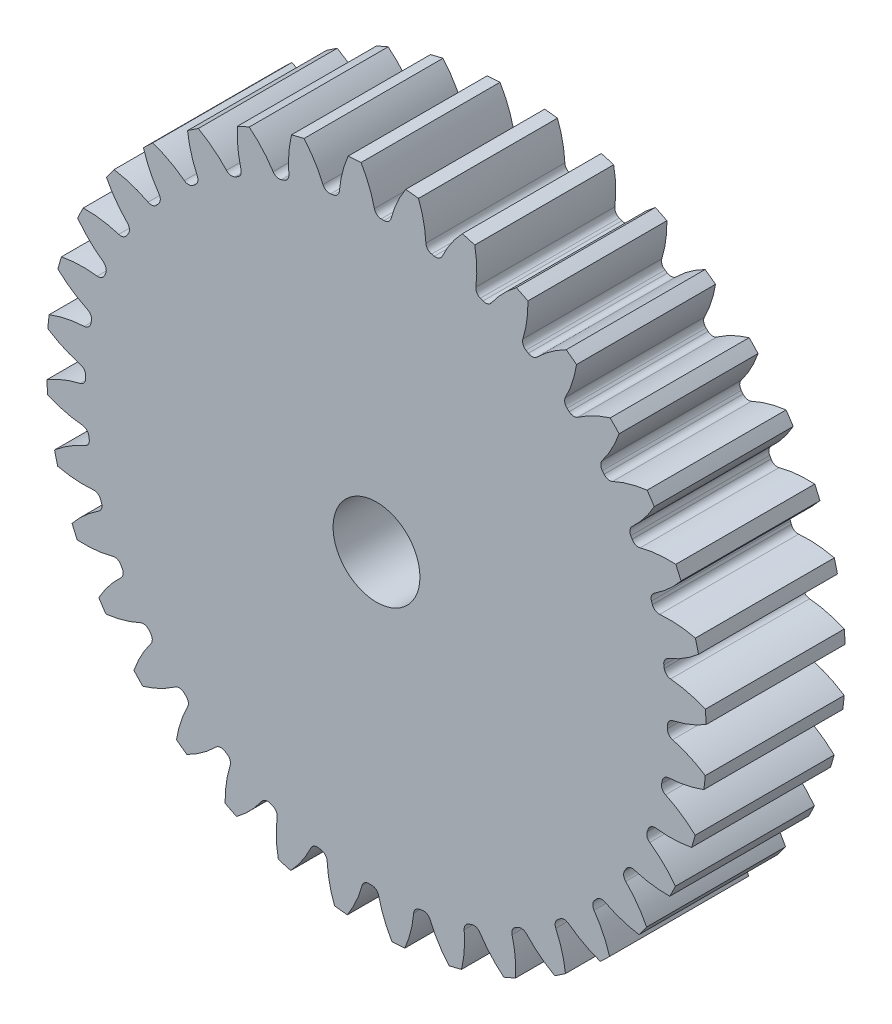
from build123d import *

# Parameters (mm, degrees)
SKETCH3_R         = 241.3
GEARBODY_DEPTH    = 101.6
TOOTHCUT_DEPTH    = 357.053282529
CIRPATTERN1_COUNT = 36
BOREDIA_R         = 31.75
BORE_DEPTH        = 12700


with BuildPart() as part:
    # Sketch3 → gearBody (new body)
    with BuildSketch(Plane.XY):
        Circle(SKETCH3_R)
    extrude(amount=GEARBODY_DEPTH)

    # Sketch2 → toothCut (cut, through all)
    with BuildSketch(Plane.XY):
        with BuildLine():
            ThreePointArc((212.65515344, -5.450810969), (212.678976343, -4.424776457), (212.697848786, -3.398638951))
            ThreePointArc((212.697848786, -3.398638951), (213.85352624, -0.222867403), (216.724480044, 1.560034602))
            ThreePointArc((216.724480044, 1.560034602), (229.412247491, 5.52895222), (241.3, 11.479842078))
            ThreePointArc((241.3, 11.479842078), (241.520657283, -5.024826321), (240.613730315, -21.506035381))
            ThreePointArc((240.613730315, -21.506035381), (228.983773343, -15.065860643), (216.472059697, -10.572668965))
            ThreePointArc((216.472059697, -10.572668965), (213.677744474, -8.671901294), (212.65515344, -5.450810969))
        make_face()
    toothcut = extrude(amount=TOOTHCUT_DEPTH, mode=Mode.SUBTRACT)

    # CirPattern1: toothCut ×36 about axis
    cirpattern1_axis = Axis((0, 0, 0), (0, 0, 1))
    for i in range(1, CIRPATTERN1_COUNT):
        add(toothcut.rotate(cirpattern1_axis, i * 360 / CIRPATTERN1_COUNT), mode=Mode.SUBTRACT)

    # boreDia → bore (cut, symmetric)
    with BuildSketch(Plane.XY):
        Circle(BOREDIA_R)
    extrude(amount=BORE_DEPTH, both=True, mode=Mode.SUBTRACT)


solid = part.part
